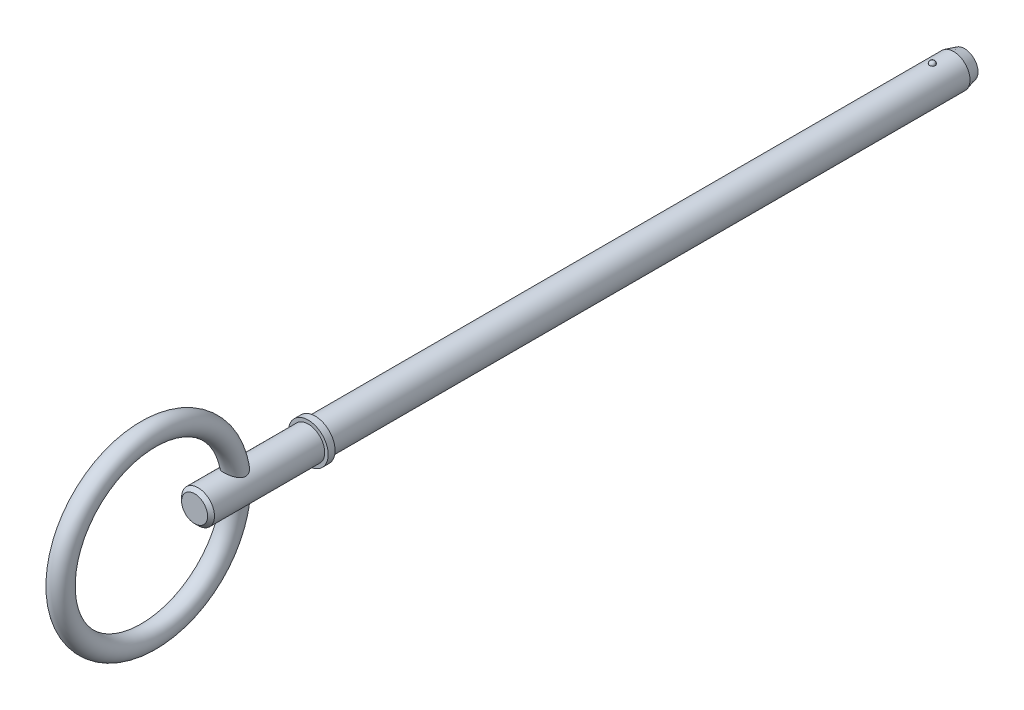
from build123d import *

# Parameters (mm, degrees)
SKETCH2_R           = 2.38
BOSS_EXTRUDE1_DEPTH = 88.9
BOSS_EXTRUDE2_START = 5.08
SKETCH3_R           = 2.38
BOSS_EXTRUDE2_DEPTH = 5.08
CHAMFER1_SIZE       = 1.586
CHAMFER1_SIZE2      = 0.424967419
SKETCH20_W          = 1
SKETCH20_H          = 2.88
SKETCH21_R          = 2.38
BOSS_EXTRUDE3_DEPTH = 17.45
CHAMFER2_SIZE       = 0.5
SKETCH24_R          = 1.5


with BuildPart() as part:
    # Sketch2 → Boss-Extrude1 (new body)
    with BuildSketch(Plane.XY):
        Circle(SKETCH2_R)
    extrude(amount=BOSS_EXTRUDE1_DEPTH)

    # Sketch3 → Boss-Extrude2 (add)
    with BuildSketch(Plane(origin=(0, 0, 0), x_dir=(-1, 0, 0), z_dir=(0, 0, -1)).offset(BOSS_EXTRUDE2_START)):
        Circle(SKETCH3_R)
    extrude(amount=-BOSS_EXTRUDE2_DEPTH)

    # Chamfer1
    chamfer1_edges = [part.edges().sort_by_distance(p)[0] for p in [
        (2.38, 0, -5.08),
    ]]
    chamfer1_side = [part.faces().sort_by_distance(p)[0] for p in [
        (2.38, 0, -2.54),
    ]]
    chamfer(chamfer1_edges, length=CHAMFER1_SIZE, length2=CHAMFER1_SIZE2, reference=chamfer1_side[0])

    # Sketch18 → Revolve1 (revolve)
    with BuildSketch(Plane(origin=(0, 0, 0), x_dir=(0, 0, -1), z_dir=(1, 0, 0))):
        with BuildLine():
            Line((0.42, 2.8), (0.42, 1.96))
            ThreePointArc((0.42, 1.96), (0, 2.38), (0.42, 2.8))
        make_face()
    revolve(axis=Axis((0, 2.8, -0.42), (0, -1, 0)))

    # Sketch20 → Revolve2 (revolve)
    with BuildSketch(Plane(origin=(0, 0, 0), x_dir=(0, 0, -1), z_dir=(1, 0, 0)), mode=Mode.PRIVATE) as revolve2_sk:
        with Locations((-89.4, 1.44)):
            Rectangle(SKETCH20_W, SKETCH20_H)
    revolve(revolve2_sk.sketch.rotate(Axis((0, 0, 33.728787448), (0, 0, 1)), 90), axis=Axis((0, 0, 33.728787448), (0, 0, 1)))

    # Sketch21 → Boss-Extrude3 (add)
    with BuildSketch(Plane(origin=(0, 0, 88.9), x_dir=(-1, 0, 0), z_dir=(0, 0, -1))):
        Circle(SKETCH21_R)
    extrude(amount=-BOSS_EXTRUDE3_DEPTH)

    # Chamfer2
    chamfer2_edges = [part.edges().sort_by_distance(p)[0] for p in [
        (2.38, 0, 106.35),
    ]]
    chamfer(chamfer2_edges, length=CHAMFER2_SIZE)

    # Sweep1: sweep along a path in Sketch23
    with BuildLine(Plane(origin=(0, 0, 0), x_dir=(0, 0, -1), z_dir=(1, 0, 0))) as sweep1_path:
        CenterArc((-113.05, 0), 12.7, 0, 360)
    # Sketch24 → Sweep1 (sweep)
    with BuildSketch(Plane(origin=(0, 0, 0), x_dir=(1, 0, 0), z_dir=(0, 1, 0))):
        with Locations((0, -100.35)):
            Circle(SKETCH24_R)
    sweep(path=sweep1_path.line)


solid = part.part
